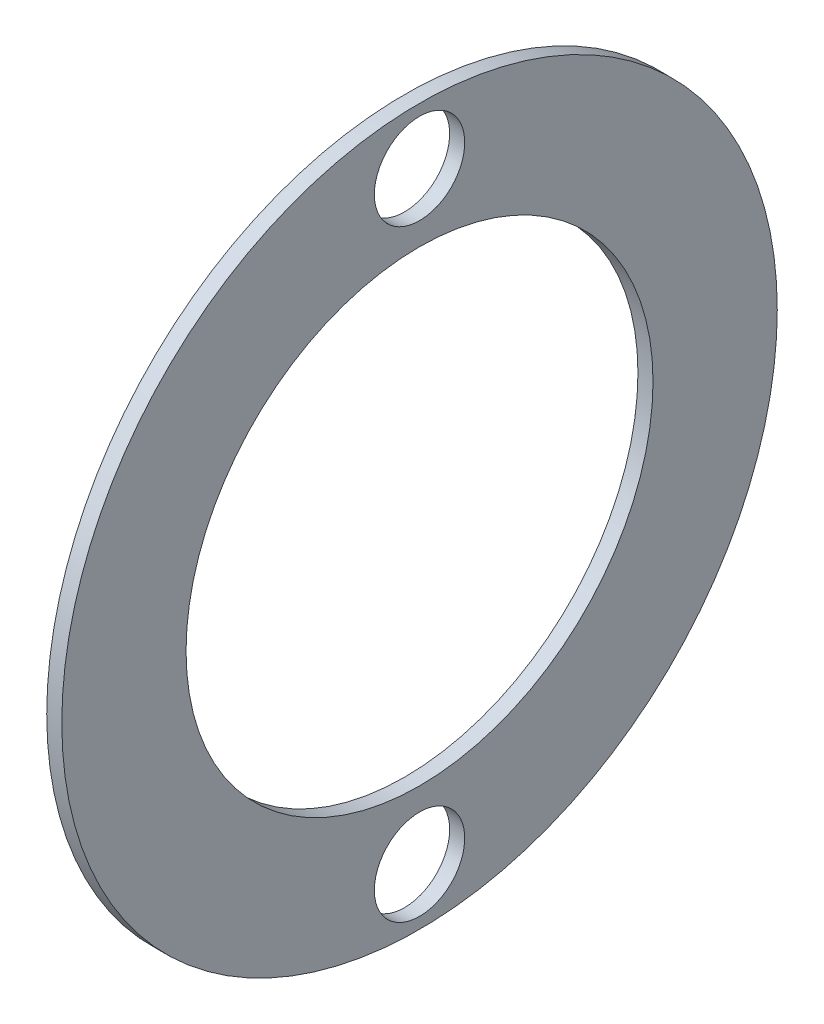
ISO-10303-21;
HEADER;
FILE_DESCRIPTION(('STEP AP214'),'2;1');
FILE_NAME('part.step','',(''),(''),'','','');
FILE_SCHEMA(('AUTOMOTIVE_DESIGN { 1 0 10303 214 1 1 1 1 }'));
ENDSEC;
DATA;
#1=APPLICATION_CONTEXT('core data for automotive mechanical design processes');
#2=APPLICATION_PROTOCOL_DEFINITION('international standard','automotive_design',2000,#1);
#3=PRODUCT_CONTEXT('',#1,'mechanical');
#4=PRODUCT('Part','Part','',(#3));
#5=PRODUCT_RELATED_PRODUCT_CATEGORY('part','',(#4));
#6=PRODUCT_DEFINITION_FORMATION('','',#4);
#7=PRODUCT_DEFINITION_CONTEXT('part definition',#1,'design');
#8=PRODUCT_DEFINITION('design','',#6,#7);
#9=PRODUCT_DEFINITION_SHAPE('','',#8);
#10=(LENGTH_UNIT() NAMED_UNIT(*) SI_UNIT(.MILLI.,.METRE.));
#11=(NAMED_UNIT(*) PLANE_ANGLE_UNIT() SI_UNIT($,.RADIAN.));
#12=(NAMED_UNIT(*) SI_UNIT($,.STERADIAN.) SOLID_ANGLE_UNIT());
#13=UNCERTAINTY_MEASURE_WITH_UNIT(LENGTH_MEASURE(1.E-05),#10,'distance_accuracy_value','');
#14=(GEOMETRIC_REPRESENTATION_CONTEXT(3) GLOBAL_UNCERTAINTY_ASSIGNED_CONTEXT((#13)) GLOBAL_UNIT_ASSIGNED_CONTEXT((#10,
#11,#12)) REPRESENTATION_CONTEXT('',''));
#15=CARTESIAN_POINT('',(0.,0.,0.));
#16=DIRECTION('',(0.,0.,1.));
#17=DIRECTION('',(1.,0.,0.));
#18=AXIS2_PLACEMENT_3D('',#15,#16,#17);
#19=CARTESIAN_POINT('',(2.,0.,0.));
#20=DIRECTION('',(-1.,0.,0.));
#21=DIRECTION('',(0.,0.,1.));
#22=AXIS2_PLACEMENT_3D('',#19,#20,#21);
#23=PLANE('',#22);
#24=CARTESIAN_POINT('',(2.,-40.,0.));
#25=DIRECTION('',(-1.,0.,0.));
#26=DIRECTION('',(0.,0.,1.));
#27=AXIS2_PLACEMENT_3D('',#24,#25,#26);
#28=CIRCLE('',#27,6.);
#29=CARTESIAN_POINT('',(2.,-40.,6.));
#30=VERTEX_POINT('',#29);
#31=EDGE_CURVE('E58',#30,#30,#28,.F.);
#32=ORIENTED_EDGE('',*,*,#31,.F.);
#33=EDGE_LOOP('',(#32));
#34=FACE_BOUND('',#33,.T.);
#35=CARTESIAN_POINT('',(2.,0.,0.));
#36=DIRECTION('',(-1.,0.,0.));
#37=DIRECTION('',(0.,0.,1.));
#38=AXIS2_PLACEMENT_3D('',#35,#36,#37);
#39=CIRCLE('',#38,31.);
#40=CARTESIAN_POINT('',(2.,0.,31.));
#41=VERTEX_POINT('',#40);
#42=EDGE_CURVE('E52',#41,#41,#39,.F.);
#43=ORIENTED_EDGE('',*,*,#42,.F.);
#44=EDGE_LOOP('',(#43));
#45=FACE_BOUND('',#44,.T.);
#46=CARTESIAN_POINT('',(2.,40.,0.));
#47=DIRECTION('',(-1.,0.,0.));
#48=DIRECTION('',(0.,0.,1.));
#49=AXIS2_PLACEMENT_3D('',#46,#47,#48);
#50=CIRCLE('',#49,6.);
#51=CARTESIAN_POINT('',(2.,40.,6.));
#52=VERTEX_POINT('',#51);
#53=EDGE_CURVE('E43',#52,#52,#50,.F.);
#54=ORIENTED_EDGE('',*,*,#53,.F.);
#55=EDGE_LOOP('',(#54));
#56=FACE_BOUND('',#55,.T.);
#57=CARTESIAN_POINT('',(2.,0.,0.));
#58=DIRECTION('',(1.,0.,0.));
#59=DIRECTION('',(0.,0.,-1.));
#60=AXIS2_PLACEMENT_3D('',#57,#58,#59);
#61=CIRCLE('',#60,47.5);
#62=CARTESIAN_POINT('',(2.,0.,-47.5));
#63=VERTEX_POINT('',#62);
#64=EDGE_CURVE('E10',#63,#63,#61,.T.);
#65=ORIENTED_EDGE('',*,*,#64,.T.);
#66=EDGE_LOOP('',(#65));
#67=FACE_BOUND('',#66,.T.);
#68=ADVANCED_FACE('F33',(#34,#45,#56,#67),#23,.F.);
#69=CARTESIAN_POINT('',(29.9069920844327,0.,0.));
#70=DIRECTION('',(1.,0.,0.));
#71=DIRECTION('',(0.,0.,-1.));
#72=AXIS2_PLACEMENT_3D('',#69,#70,#71);
#73=CYLINDRICAL_SURFACE('',#72,47.5);
#74=ORIENTED_EDGE('',*,*,#64,.F.);
#75=EDGE_LOOP('',(#74));
#76=FACE_BOUND('',#75,.T.);
#77=CARTESIAN_POINT('',(0.,0.,0.));
#78=DIRECTION('',(1.,0.,0.));
#79=DIRECTION('',(0.,0.,-1.));
#80=AXIS2_PLACEMENT_3D('',#77,#78,#79);
#81=CIRCLE('',#80,47.5);
#82=CARTESIAN_POINT('',(0.,0.,-47.5));
#83=VERTEX_POINT('',#82);
#84=EDGE_CURVE('E39',#83,#83,#81,.T.);
#85=ORIENTED_EDGE('',*,*,#84,.T.);
#86=EDGE_LOOP('',(#85));
#87=FACE_BOUND('',#86,.T.);
#88=ADVANCED_FACE('F72',(#76,#87),#73,.T.);
#89=CARTESIAN_POINT('',(0.,0.,0.));
#90=DIRECTION('',(1.,0.,0.));
#91=DIRECTION('',(0.,0.,-1.));
#92=AXIS2_PLACEMENT_3D('',#89,#90,#91);
#93=PLANE('',#92);
#94=CARTESIAN_POINT('',(0.,-40.,0.));
#95=DIRECTION('',(-1.,0.,0.));
#96=DIRECTION('',(0.,0.,-1.));
#97=AXIS2_PLACEMENT_3D('',#94,#95,#96);
#98=CIRCLE('',#97,6.);
#99=CARTESIAN_POINT('',(0.,-40.,-6.));
#100=VERTEX_POINT('',#99);
#101=EDGE_CURVE('E61',#100,#100,#98,.T.);
#102=ORIENTED_EDGE('',*,*,#101,.F.);
#103=EDGE_LOOP('',(#102));
#104=FACE_BOUND('',#103,.T.);
#105=CARTESIAN_POINT('',(0.,0.,0.));
#106=DIRECTION('',(-1.,0.,0.));
#107=DIRECTION('',(0.,0.,1.));
#108=AXIS2_PLACEMENT_3D('',#105,#106,#107);
#109=CIRCLE('',#108,31.);
#110=CARTESIAN_POINT('',(0.,0.,31.));
#111=VERTEX_POINT('',#110);
#112=EDGE_CURVE('E55',#111,#111,#109,.T.);
#113=ORIENTED_EDGE('',*,*,#112,.F.);
#114=EDGE_LOOP('',(#113));
#115=FACE_BOUND('',#114,.T.);
#116=CARTESIAN_POINT('',(0.,40.,0.));
#117=DIRECTION('',(-1.,0.,0.));
#118=DIRECTION('',(0.,0.,1.));
#119=AXIS2_PLACEMENT_3D('',#116,#117,#118);
#120=CIRCLE('',#119,6.);
#121=CARTESIAN_POINT('',(0.,40.,6.));
#122=VERTEX_POINT('',#121);
#123=EDGE_CURVE('E47',#122,#122,#120,.T.);
#124=ORIENTED_EDGE('',*,*,#123,.F.);
#125=EDGE_LOOP('',(#124));
#126=FACE_BOUND('',#125,.T.);
#127=ORIENTED_EDGE('',*,*,#84,.F.);
#128=EDGE_LOOP('',(#127));
#129=FACE_BOUND('',#128,.T.);
#130=ADVANCED_FACE('F68',(#104,#115,#126,#129),#93,.F.);
#131=CARTESIAN_POINT('',(2.001,40.,0.));
#132=DIRECTION('',(-1.,0.,0.));
#133=DIRECTION('',(0.,0.,1.));
#134=AXIS2_PLACEMENT_3D('',#131,#132,#133);
#135=CYLINDRICAL_SURFACE('',#134,6.);
#136=ORIENTED_EDGE('',*,*,#123,.T.);
#137=EDGE_LOOP('',(#136));
#138=FACE_BOUND('',#137,.T.);
#139=ORIENTED_EDGE('',*,*,#53,.T.);
#140=EDGE_LOOP('',(#139));
#141=FACE_BOUND('',#140,.T.);
#142=ADVANCED_FACE('F71',(#138,#141),#135,.F.);
#143=CARTESIAN_POINT('',(2.001,0.,0.));
#144=DIRECTION('',(-1.,0.,0.));
#145=DIRECTION('',(0.,0.,1.));
#146=AXIS2_PLACEMENT_3D('',#143,#144,#145);
#147=CYLINDRICAL_SURFACE('',#146,31.);
#148=ORIENTED_EDGE('',*,*,#112,.T.);
#149=EDGE_LOOP('',(#148));
#150=FACE_BOUND('',#149,.T.);
#151=ORIENTED_EDGE('',*,*,#42,.T.);
#152=EDGE_LOOP('',(#151));
#153=FACE_BOUND('',#152,.T.);
#154=ADVANCED_FACE('F81',(#150,#153),#147,.F.);
#155=CARTESIAN_POINT('',(2.001,-40.,0.));
#156=DIRECTION('',(-1.,0.,0.));
#157=DIRECTION('',(0.,0.,1.));
#158=AXIS2_PLACEMENT_3D('',#155,#156,#157);
#159=CYLINDRICAL_SURFACE('',#158,6.);
#160=ORIENTED_EDGE('',*,*,#101,.T.);
#161=EDGE_LOOP('',(#160));
#162=FACE_BOUND('',#161,.T.);
#163=ORIENTED_EDGE('',*,*,#31,.T.);
#164=EDGE_LOOP('',(#163));
#165=FACE_BOUND('',#164,.T.);
#166=ADVANCED_FACE('F65',(#162,#165),#159,.F.);
#167=CLOSED_SHELL('',(#68,#88,#130,#142,#154,#166));
#168=MANIFOLD_SOLID_BREP('B2',#167);
#169=ADVANCED_BREP_SHAPE_REPRESENTATION('',(#18,#168),#14);
#170=SHAPE_DEFINITION_REPRESENTATION(#9,#169);
ENDSEC;
END-ISO-10303-21;
